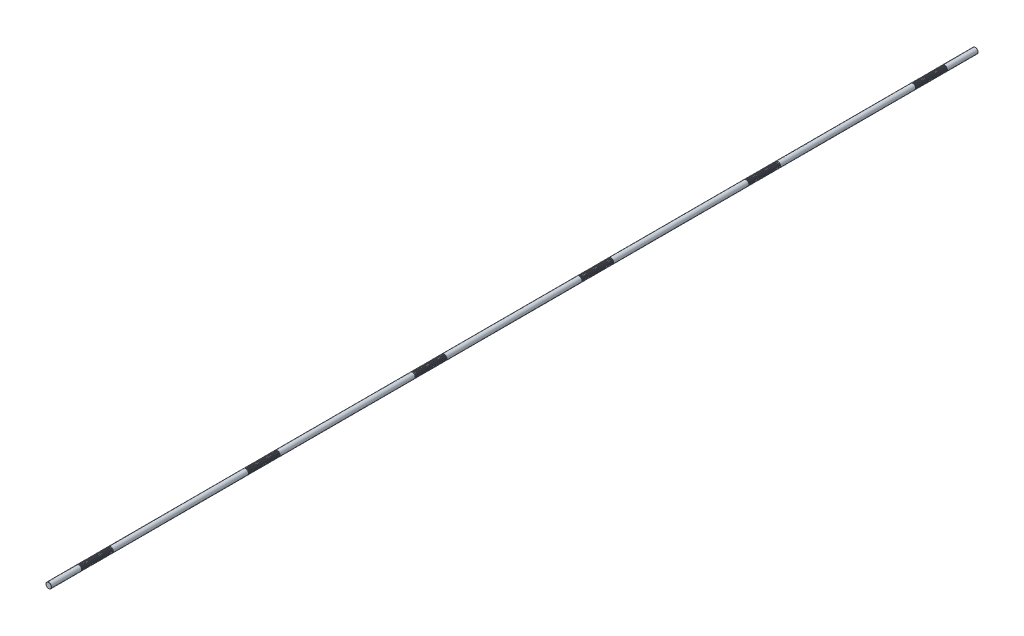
from build123d import *

# Parameters (mm, degrees)
SKETCH1_R           = 9
BOSS_EXTRUDE1_DEPTH = 1500
CHAMFER1_SIZE       = 0.45
LPATTERN1_COUNT     = 26
LPATTERN1_PITCH     = 4
LPATTERN2_COUNT     = 6
LPATTERN2_PITCH     = 540


with BuildPart() as part:
    # Sketch1 → Boss-Extrude1 (new, symmetric)
    with BuildSketch(Plane.XY):
        Circle(SKETCH1_R)
    extrude(amount=BOSS_EXTRUDE1_DEPTH, both=True)

    # Chamfer1
    chamfer1_edges = [part.edges().sort_by_distance(p)[0] for p in [
        (-9, 0, -1500),
        (-9, 0, 1500),
    ]]
    chamfer(chamfer1_edges, length=CHAMFER1_SIZE)

    # Sketch2 → Cut-Revolve1 (revolve, cut)
    with BuildSketch(Plane(origin=(0, 0, 0), x_dir=(0, 0, -1), z_dir=(1, 0, 0)), mode=Mode.PRIVATE) as cut_revolve1_sk:
        Polygon((1400.301442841, 9), (1397.698557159, 9), (1398.301442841, 6.75), (1399.698557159, 6.75), align=None)
    cut_revolve1 = revolve(cut_revolve1_sk.sketch.rotate(Axis((0, 0, 1500), (0, 0, -1)), 90), axis=Axis((0, 0, 1500), (0, 0, -1)), mode=Mode.SUBTRACT)

    # LPattern1: Cut-Revolve1 ×26
    with Locations(*[(0, 0, i * LPATTERN1_PITCH) for i in range(1, LPATTERN1_COUNT)]):
        add(cut_revolve1, mode=Mode.SUBTRACT)

    # LPattern2: Cut-Revolve1 ×6
    with Locations(*[(0, 0, i * LPATTERN2_PITCH) for i in range(1, LPATTERN2_COUNT)]):
        add(cut_revolve1, mode=Mode.SUBTRACT)

    # LPattern2 copy 1 sketch → LPattern2 copy 1 (revolve, cut)
    with BuildSketch(Plane(origin=(0, 0, 544), x_dir=(0, 0, -1), z_dir=(1, 0, 0))):
        Polygon((1400.301442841, 9), (1397.698557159, 9), (1398.301442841, 6.75), (1399.698557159, 6.75), align=None)
    revolve(axis=Axis((0, 0, 2044), (0, 0, -1)), mode=Mode.SUBTRACT)

    # LPattern2 copy 2 sketch → LPattern2 copy 2 (revolve, cut)
    with BuildSketch(Plane(origin=(0, 0, 1084), x_dir=(0, 0, -1), z_dir=(1, 0, 0))):
        Polygon((1400.301442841, 9), (1397.698557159, 9), (1398.301442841, 6.75), (1399.698557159, 6.75), align=None)
    revolve(axis=Axis((0, 0, 2584), (0, 0, -1)), mode=Mode.SUBTRACT)

    # LPattern2 copy 3 sketch → LPattern2 copy 3 (revolve, cut)
    with BuildSketch(Plane(origin=(0, 0, 1624), x_dir=(0, 0, -1), z_dir=(1, 0, 0))):
        Polygon((1400.301442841, 9), (1397.698557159, 9), (1398.301442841, 6.75), (1399.698557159, 6.75), align=None)
    revolve(axis=Axis((0, 0, 3124), (0, 0, -1)), mode=Mode.SUBTRACT)

    # LPattern2 copy 4 sketch → LPattern2 copy 4 (revolve, cut)
    with BuildSketch(Plane(origin=(0, 0, 2164), x_dir=(0, 0, -1), z_dir=(1, 0, 0))):
        Polygon((1400.301442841, 9), (1397.698557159, 9), (1398.301442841, 6.75), (1399.698557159, 6.75), align=None)
    revolve(axis=Axis((0, 0, 3664), (0, 0, -1)), mode=Mode.SUBTRACT)

    # LPattern2 copy 5 sketch → LPattern2 copy 5 (revolve, cut)
    with BuildSketch(Plane(origin=(0, 0, 2704), x_dir=(0, 0, -1), z_dir=(1, 0, 0))):
        Polygon((1400.301442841, 9), (1397.698557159, 9), (1398.301442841, 6.75), (1399.698557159, 6.75), align=None)
    revolve(axis=Axis((0, 0, 4204), (0, 0, -1)), mode=Mode.SUBTRACT)

    # LPattern2 copy 6 sketch → LPattern2 copy 6 (revolve, cut)
    with BuildSketch(Plane(origin=(0, 0, 548), x_dir=(0, 0, -1), z_dir=(1, 0, 0))):
        Polygon((1400.301442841, 9), (1397.698557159, 9), (1398.301442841, 6.75), (1399.698557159, 6.75), align=None)
    revolve(axis=Axis((0, 0, 2048), (0, 0, -1)), mode=Mode.SUBTRACT)

    # LPattern2 copy 7 sketch → LPattern2 copy 7 (revolve, cut)
    with BuildSketch(Plane(origin=(0, 0, 1088), x_dir=(0, 0, -1), z_dir=(1, 0, 0))):
        Polygon((1400.301442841, 9), (1397.698557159, 9), (1398.301442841, 6.75), (1399.698557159, 6.75), align=None)
    revolve(axis=Axis((0, 0, 2588), (0, 0, -1)), mode=Mode.SUBTRACT)

    # LPattern2 copy 8 sketch → LPattern2 copy 8 (revolve, cut)
    with BuildSketch(Plane(origin=(0, 0, 1628), x_dir=(0, 0, -1), z_dir=(1, 0, 0))):
        Polygon((1400.301442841, 9), (1397.698557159, 9), (1398.301442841, 6.75), (1399.698557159, 6.75), align=None)
    revolve(axis=Axis((0, 0, 3128), (0, 0, -1)), mode=Mode.SUBTRACT)

    # LPattern2 copy 9 sketch → LPattern2 copy 9 (revolve, cut)
    with BuildSketch(Plane(origin=(0, 0, 2168), x_dir=(0, 0, -1), z_dir=(1, 0, 0))):
        Polygon((1400.301442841, 9), (1397.698557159, 9), (1398.301442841, 6.75), (1399.698557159, 6.75), align=None)
    revolve(axis=Axis((0, 0, 3668), (0, 0, -1)), mode=Mode.SUBTRACT)

    # LPattern2 copy 10 sketch → LPattern2 copy 10 (revolve, cut)
    with BuildSketch(Plane(origin=(0, 0, 2708), x_dir=(0, 0, -1), z_dir=(1, 0, 0))):
        Polygon((1400.301442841, 9), (1397.698557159, 9), (1398.301442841, 6.75), (1399.698557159, 6.75), align=None)
    revolve(axis=Axis((0, 0, 4208), (0, 0, -1)), mode=Mode.SUBTRACT)

    # LPattern2 copy 11 sketch → LPattern2 copy 11 (revolve, cut)
    with BuildSketch(Plane(origin=(0, 0, 552), x_dir=(0, 0, -1), z_dir=(1, 0, 0))):
        Polygon((1400.301442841, 9), (1397.698557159, 9), (1398.301442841, 6.75), (1399.698557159, 6.75), align=None)
    revolve(axis=Axis((0, 0, 2052), (0, 0, -1)), mode=Mode.SUBTRACT)

    # LPattern2 copy 12 sketch → LPattern2 copy 12 (revolve, cut)
    with BuildSketch(Plane(origin=(0, 0, 1092), x_dir=(0, 0, -1), z_dir=(1, 0, 0))):
        Polygon((1400.301442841, 9), (1397.698557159, 9), (1398.301442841, 6.75), (1399.698557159, 6.75), align=None)
    revolve(axis=Axis((0, 0, 2592), (0, 0, -1)), mode=Mode.SUBTRACT)

    # LPattern2 copy 13 sketch → LPattern2 copy 13 (revolve, cut)
    with BuildSketch(Plane(origin=(0, 0, 1632), x_dir=(0, 0, -1), z_dir=(1, 0, 0))):
        Polygon((1400.301442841, 9), (1397.698557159, 9), (1398.301442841, 6.75), (1399.698557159, 6.75), align=None)
    revolve(axis=Axis((0, 0, 3132), (0, 0, -1)), mode=Mode.SUBTRACT)

    # LPattern2 copy 14 sketch → LPattern2 copy 14 (revolve, cut)
    with BuildSketch(Plane(origin=(0, 0, 2172), x_dir=(0, 0, -1), z_dir=(1, 0, 0))):
        Polygon((1400.301442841, 9), (1397.698557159, 9), (1398.301442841, 6.75), (1399.698557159, 6.75), align=None)
    revolve(axis=Axis((0, 0, 3672), (0, 0, -1)), mode=Mode.SUBTRACT)

    # LPattern2 copy 15 sketch → LPattern2 copy 15 (revolve, cut)
    with BuildSketch(Plane(origin=(0, 0, 2712), x_dir=(0, 0, -1), z_dir=(1, 0, 0))):
        Polygon((1400.301442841, 9), (1397.698557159, 9), (1398.301442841, 6.75), (1399.698557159, 6.75), align=None)
    revolve(axis=Axis((0, 0, 4212), (0, 0, -1)), mode=Mode.SUBTRACT)

    # LPattern2 copy 16 sketch → LPattern2 copy 16 (revolve, cut)
    with BuildSketch(Plane(origin=(0, 0, 556), x_dir=(0, 0, -1), z_dir=(1, 0, 0))):
        Polygon((1400.301442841, 9), (1397.698557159, 9), (1398.301442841, 6.75), (1399.698557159, 6.75), align=None)
    revolve(axis=Axis((0, 0, 2056), (0, 0, -1)), mode=Mode.SUBTRACT)

    # LPattern2 copy 17 sketch → LPattern2 copy 17 (revolve, cut)
    with BuildSketch(Plane(origin=(0, 0, 1096), x_dir=(0, 0, -1), z_dir=(1, 0, 0))):
        Polygon((1400.301442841, 9), (1397.698557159, 9), (1398.301442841, 6.75), (1399.698557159, 6.75), align=None)
    revolve(axis=Axis((0, 0, 2596), (0, 0, -1)), mode=Mode.SUBTRACT)

    # LPattern2 copy 18 sketch → LPattern2 copy 18 (revolve, cut)
    with BuildSketch(Plane(origin=(0, 0, 1636), x_dir=(0, 0, -1), z_dir=(1, 0, 0))):
        Polygon((1400.301442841, 9), (1397.698557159, 9), (1398.301442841, 6.75), (1399.698557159, 6.75), align=None)
    revolve(axis=Axis((0, 0, 3136), (0, 0, -1)), mode=Mode.SUBTRACT)

    # LPattern2 copy 19 sketch → LPattern2 copy 19 (revolve, cut)
    with BuildSketch(Plane(origin=(0, 0, 2176), x_dir=(0, 0, -1), z_dir=(1, 0, 0))):
        Polygon((1400.301442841, 9), (1397.698557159, 9), (1398.301442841, 6.75), (1399.698557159, 6.75), align=None)
    revolve(axis=Axis((0, 0, 3676), (0, 0, -1)), mode=Mode.SUBTRACT)

    # LPattern2 copy 20 sketch → LPattern2 copy 20 (revolve, cut)
    with BuildSketch(Plane(origin=(0, 0, 2716), x_dir=(0, 0, -1), z_dir=(1, 0, 0))):
        Polygon((1400.301442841, 9), (1397.698557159, 9), (1398.301442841, 6.75), (1399.698557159, 6.75), align=None)
    revolve(axis=Axis((0, 0, 4216), (0, 0, -1)), mode=Mode.SUBTRACT)

    # LPattern2 copy 21 sketch → LPattern2 copy 21 (revolve, cut)
    with BuildSketch(Plane(origin=(0, 0, 560), x_dir=(0, 0, -1), z_dir=(1, 0, 0))):
        Polygon((1400.301442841, 9), (1397.698557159, 9), (1398.301442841, 6.75), (1399.698557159, 6.75), align=None)
    revolve(axis=Axis((0, 0, 2060), (0, 0, -1)), mode=Mode.SUBTRACT)

    # LPattern2 copy 22 sketch → LPattern2 copy 22 (revolve, cut)
    with BuildSketch(Plane(origin=(0, 0, 1100), x_dir=(0, 0, -1), z_dir=(1, 0, 0))):
        Polygon((1400.301442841, 9), (1397.698557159, 9), (1398.301442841, 6.75), (1399.698557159, 6.75), align=None)
    revolve(axis=Axis((0, 0, 2600), (0, 0, -1)), mode=Mode.SUBTRACT)

    # LPattern2 copy 23 sketch → LPattern2 copy 23 (revolve, cut)
    with BuildSketch(Plane(origin=(0, 0, 1640), x_dir=(0, 0, -1), z_dir=(1, 0, 0))):
        Polygon((1400.301442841, 9), (1397.698557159, 9), (1398.301442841, 6.75), (1399.698557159, 6.75), align=None)
    revolve(axis=Axis((0, 0, 3140), (0, 0, -1)), mode=Mode.SUBTRACT)

    # LPattern2 copy 24 sketch → LPattern2 copy 24 (revolve, cut)
    with BuildSketch(Plane(origin=(0, 0, 2180), x_dir=(0, 0, -1), z_dir=(1, 0, 0))):
        Polygon((1400.301442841, 9), (1397.698557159, 9), (1398.301442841, 6.75), (1399.698557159, 6.75), align=None)
    revolve(axis=Axis((0, 0, 3680), (0, 0, -1)), mode=Mode.SUBTRACT)

    # LPattern2 copy 25 sketch → LPattern2 copy 25 (revolve, cut)
    with BuildSketch(Plane(origin=(0, 0, 2720), x_dir=(0, 0, -1), z_dir=(1, 0, 0))):
        Polygon((1400.301442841, 9), (1397.698557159, 9), (1398.301442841, 6.75), (1399.698557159, 6.75), align=None)
    revolve(axis=Axis((0, 0, 4220), (0, 0, -1)), mode=Mode.SUBTRACT)

    # LPattern2 copy 26 sketch → LPattern2 copy 26 (revolve, cut)
    with BuildSketch(Plane(origin=(0, 0, 564), x_dir=(0, 0, -1), z_dir=(1, 0, 0))):
        Polygon((1400.301442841, 9), (1397.698557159, 9), (1398.301442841, 6.75), (1399.698557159, 6.75), align=None)
    revolve(axis=Axis((0, 0, 2064), (0, 0, -1)), mode=Mode.SUBTRACT)

    # LPattern2 copy 27 sketch → LPattern2 copy 27 (revolve, cut)
    with BuildSketch(Plane(origin=(0, 0, 1104), x_dir=(0, 0, -1), z_dir=(1, 0, 0))):
        Polygon((1400.301442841, 9), (1397.698557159, 9), (1398.301442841, 6.75), (1399.698557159, 6.75), align=None)
    revolve(axis=Axis((0, 0, 2604), (0, 0, -1)), mode=Mode.SUBTRACT)

    # LPattern2 copy 28 sketch → LPattern2 copy 28 (revolve, cut)
    with BuildSketch(Plane(origin=(0, 0, 1644), x_dir=(0, 0, -1), z_dir=(1, 0, 0))):
        Polygon((1400.301442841, 9), (1397.698557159, 9), (1398.301442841, 6.75), (1399.698557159, 6.75), align=None)
    revolve(axis=Axis((0, 0, 3144), (0, 0, -1)), mode=Mode.SUBTRACT)

    # LPattern2 copy 29 sketch → LPattern2 copy 29 (revolve, cut)
    with BuildSketch(Plane(origin=(0, 0, 2184), x_dir=(0, 0, -1), z_dir=(1, 0, 0))):
        Polygon((1400.301442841, 9), (1397.698557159, 9), (1398.301442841, 6.75), (1399.698557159, 6.75), align=None)
    revolve(axis=Axis((0, 0, 3684), (0, 0, -1)), mode=Mode.SUBTRACT)

    # LPattern2 copy 30 sketch → LPattern2 copy 30 (revolve, cut)
    with BuildSketch(Plane(origin=(0, 0, 2724), x_dir=(0, 0, -1), z_dir=(1, 0, 0))):
        Polygon((1400.301442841, 9), (1397.698557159, 9), (1398.301442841, 6.75), (1399.698557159, 6.75), align=None)
    revolve(axis=Axis((0, 0, 4224), (0, 0, -1)), mode=Mode.SUBTRACT)

    # LPattern2 copy 31 sketch → LPattern2 copy 31 (revolve, cut)
    with BuildSketch(Plane(origin=(0, 0, 568), x_dir=(0, 0, -1), z_dir=(1, 0, 0))):
        Polygon((1400.301442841, 9), (1397.698557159, 9), (1398.301442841, 6.75), (1399.698557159, 6.75), align=None)
    revolve(axis=Axis((0, 0, 2068), (0, 0, -1)), mode=Mode.SUBTRACT)

    # LPattern2 copy 32 sketch → LPattern2 copy 32 (revolve, cut)
    with BuildSketch(Plane(origin=(0, 0, 1108), x_dir=(0, 0, -1), z_dir=(1, 0, 0))):
        Polygon((1400.301442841, 9), (1397.698557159, 9), (1398.301442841, 6.75), (1399.698557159, 6.75), align=None)
    revolve(axis=Axis((0, 0, 2608), (0, 0, -1)), mode=Mode.SUBTRACT)

    # LPattern2 copy 33 sketch → LPattern2 copy 33 (revolve, cut)
    with BuildSketch(Plane(origin=(0, 0, 1648), x_dir=(0, 0, -1), z_dir=(1, 0, 0))):
        Polygon((1400.301442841, 9), (1397.698557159, 9), (1398.301442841, 6.75), (1399.698557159, 6.75), align=None)
    revolve(axis=Axis((0, 0, 3148), (0, 0, -1)), mode=Mode.SUBTRACT)

    # LPattern2 copy 34 sketch → LPattern2 copy 34 (revolve, cut)
    with BuildSketch(Plane(origin=(0, 0, 2188), x_dir=(0, 0, -1), z_dir=(1, 0, 0))):
        Polygon((1400.301442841, 9), (1397.698557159, 9), (1398.301442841, 6.75), (1399.698557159, 6.75), align=None)
    revolve(axis=Axis((0, 0, 3688), (0, 0, -1)), mode=Mode.SUBTRACT)

    # LPattern2 copy 35 sketch → LPattern2 copy 35 (revolve, cut)
    with BuildSketch(Plane(origin=(0, 0, 2728), x_dir=(0, 0, -1), z_dir=(1, 0, 0))):
        Polygon((1400.301442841, 9), (1397.698557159, 9), (1398.301442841, 6.75), (1399.698557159, 6.75), align=None)
    revolve(axis=Axis((0, 0, 4228), (0, 0, -1)), mode=Mode.SUBTRACT)

    # LPattern2 copy 36 sketch → LPattern2 copy 36 (revolve, cut)
    with BuildSketch(Plane(origin=(0, 0, 572), x_dir=(0, 0, -1), z_dir=(1, 0, 0))):
        Polygon((1400.301442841, 9), (1397.698557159, 9), (1398.301442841, 6.75), (1399.698557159, 6.75), align=None)
    revolve(axis=Axis((0, 0, 2072), (0, 0, -1)), mode=Mode.SUBTRACT)

    # LPattern2 copy 37 sketch → LPattern2 copy 37 (revolve, cut)
    with BuildSketch(Plane(origin=(0, 0, 1112), x_dir=(0, 0, -1), z_dir=(1, 0, 0))):
        Polygon((1400.301442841, 9), (1397.698557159, 9), (1398.301442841, 6.75), (1399.698557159, 6.75), align=None)
    revolve(axis=Axis((0, 0, 2612), (0, 0, -1)), mode=Mode.SUBTRACT)

    # LPattern2 copy 38 sketch → LPattern2 copy 38 (revolve, cut)
    with BuildSketch(Plane(origin=(0, 0, 1652), x_dir=(0, 0, -1), z_dir=(1, 0, 0))):
        Polygon((1400.301442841, 9), (1397.698557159, 9), (1398.301442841, 6.75), (1399.698557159, 6.75), align=None)
    revolve(axis=Axis((0, 0, 3152), (0, 0, -1)), mode=Mode.SUBTRACT)

    # LPattern2 copy 39 sketch → LPattern2 copy 39 (revolve, cut)
    with BuildSketch(Plane(origin=(0, 0, 2192), x_dir=(0, 0, -1), z_dir=(1, 0, 0))):
        Polygon((1400.301442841, 9), (1397.698557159, 9), (1398.301442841, 6.75), (1399.698557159, 6.75), align=None)
    revolve(axis=Axis((0, 0, 3692), (0, 0, -1)), mode=Mode.SUBTRACT)

    # LPattern2 copy 40 sketch → LPattern2 copy 40 (revolve, cut)
    with BuildSketch(Plane(origin=(0, 0, 2732), x_dir=(0, 0, -1), z_dir=(1, 0, 0))):
        Polygon((1400.301442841, 9), (1397.698557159, 9), (1398.301442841, 6.75), (1399.698557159, 6.75), align=None)
    revolve(axis=Axis((0, 0, 4232), (0, 0, -1)), mode=Mode.SUBTRACT)

    # LPattern2 copy 41 sketch → LPattern2 copy 41 (revolve, cut)
    with BuildSketch(Plane(origin=(0, 0, 576), x_dir=(0, 0, -1), z_dir=(1, 0, 0))):
        Polygon((1400.301442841, 9), (1397.698557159, 9), (1398.301442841, 6.75), (1399.698557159, 6.75), align=None)
    revolve(axis=Axis((0, 0, 2076), (0, 0, -1)), mode=Mode.SUBTRACT)

    # LPattern2 copy 42 sketch → LPattern2 copy 42 (revolve, cut)
    with BuildSketch(Plane(origin=(0, 0, 1116), x_dir=(0, 0, -1), z_dir=(1, 0, 0))):
        Polygon((1400.301442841, 9), (1397.698557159, 9), (1398.301442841, 6.75), (1399.698557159, 6.75), align=None)
    revolve(axis=Axis((0, 0, 2616), (0, 0, -1)), mode=Mode.SUBTRACT)

    # LPattern2 copy 43 sketch → LPattern2 copy 43 (revolve, cut)
    with BuildSketch(Plane(origin=(0, 0, 1656), x_dir=(0, 0, -1), z_dir=(1, 0, 0))):
        Polygon((1400.301442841, 9), (1397.698557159, 9), (1398.301442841, 6.75), (1399.698557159, 6.75), align=None)
    revolve(axis=Axis((0, 0, 3156), (0, 0, -1)), mode=Mode.SUBTRACT)

    # LPattern2 copy 44 sketch → LPattern2 copy 44 (revolve, cut)
    with BuildSketch(Plane(origin=(0, 0, 2196), x_dir=(0, 0, -1), z_dir=(1, 0, 0))):
        Polygon((1400.301442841, 9), (1397.698557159, 9), (1398.301442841, 6.75), (1399.698557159, 6.75), align=None)
    revolve(axis=Axis((0, 0, 3696), (0, 0, -1)), mode=Mode.SUBTRACT)

    # LPattern2 copy 45 sketch → LPattern2 copy 45 (revolve, cut)
    with BuildSketch(Plane(origin=(0, 0, 2736), x_dir=(0, 0, -1), z_dir=(1, 0, 0))):
        Polygon((1400.301442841, 9), (1397.698557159, 9), (1398.301442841, 6.75), (1399.698557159, 6.75), align=None)
    revolve(axis=Axis((0, 0, 4236), (0, 0, -1)), mode=Mode.SUBTRACT)

    # LPattern2 copy 46 sketch → LPattern2 copy 46 (revolve, cut)
    with BuildSketch(Plane(origin=(0, 0, 580), x_dir=(0, 0, -1), z_dir=(1, 0, 0))):
        Polygon((1400.301442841, 9), (1397.698557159, 9), (1398.301442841, 6.75), (1399.698557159, 6.75), align=None)
    revolve(axis=Axis((0, 0, 2080), (0, 0, -1)), mode=Mode.SUBTRACT)

    # LPattern2 copy 47 sketch → LPattern2 copy 47 (revolve, cut)
    with BuildSketch(Plane(origin=(0, 0, 1120), x_dir=(0, 0, -1), z_dir=(1, 0, 0))):
        Polygon((1400.301442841, 9), (1397.698557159, 9), (1398.301442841, 6.75), (1399.698557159, 6.75), align=None)
    revolve(axis=Axis((0, 0, 2620), (0, 0, -1)), mode=Mode.SUBTRACT)

    # LPattern2 copy 48 sketch → LPattern2 copy 48 (revolve, cut)
    with BuildSketch(Plane(origin=(0, 0, 1660), x_dir=(0, 0, -1), z_dir=(1, 0, 0))):
        Polygon((1400.301442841, 9), (1397.698557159, 9), (1398.301442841, 6.75), (1399.698557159, 6.75), align=None)
    revolve(axis=Axis((0, 0, 3160), (0, 0, -1)), mode=Mode.SUBTRACT)

    # LPattern2 copy 49 sketch → LPattern2 copy 49 (revolve, cut)
    with BuildSketch(Plane(origin=(0, 0, 2200), x_dir=(0, 0, -1), z_dir=(1, 0, 0))):
        Polygon((1400.301442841, 9), (1397.698557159, 9), (1398.301442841, 6.75), (1399.698557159, 6.75), align=None)
    revolve(axis=Axis((0, 0, 3700), (0, 0, -1)), mode=Mode.SUBTRACT)

    # LPattern2 copy 50 sketch → LPattern2 copy 50 (revolve, cut)
    with BuildSketch(Plane(origin=(0, 0, 2740), x_dir=(0, 0, -1), z_dir=(1, 0, 0))):
        Polygon((1400.301442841, 9), (1397.698557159, 9), (1398.301442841, 6.75), (1399.698557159, 6.75), align=None)
    revolve(axis=Axis((0, 0, 4240), (0, 0, -1)), mode=Mode.SUBTRACT)

    # LPattern2 copy 51 sketch → LPattern2 copy 51 (revolve, cut)
    with BuildSketch(Plane(origin=(0, 0, 584), x_dir=(0, 0, -1), z_dir=(1, 0, 0))):
        Polygon((1400.301442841, 9), (1397.698557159, 9), (1398.301442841, 6.75), (1399.698557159, 6.75), align=None)
    revolve(axis=Axis((0, 0, 2084), (0, 0, -1)), mode=Mode.SUBTRACT)

    # LPattern2 copy 52 sketch → LPattern2 copy 52 (revolve, cut)
    with BuildSketch(Plane(origin=(0, 0, 1124), x_dir=(0, 0, -1), z_dir=(1, 0, 0))):
        Polygon((1400.301442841, 9), (1397.698557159, 9), (1398.301442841, 6.75), (1399.698557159, 6.75), align=None)
    revolve(axis=Axis((0, 0, 2624), (0, 0, -1)), mode=Mode.SUBTRACT)

    # LPattern2 copy 53 sketch → LPattern2 copy 53 (revolve, cut)
    with BuildSketch(Plane(origin=(0, 0, 1664), x_dir=(0, 0, -1), z_dir=(1, 0, 0))):
        Polygon((1400.301442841, 9), (1397.698557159, 9), (1398.301442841, 6.75), (1399.698557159, 6.75), align=None)
    revolve(axis=Axis((0, 0, 3164), (0, 0, -1)), mode=Mode.SUBTRACT)

    # LPattern2 copy 54 sketch → LPattern2 copy 54 (revolve, cut)
    with BuildSketch(Plane(origin=(0, 0, 2204), x_dir=(0, 0, -1), z_dir=(1, 0, 0))):
        Polygon((1400.301442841, 9), (1397.698557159, 9), (1398.301442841, 6.75), (1399.698557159, 6.75), align=None)
    revolve(axis=Axis((0, 0, 3704), (0, 0, -1)), mode=Mode.SUBTRACT)

    # LPattern2 copy 55 sketch → LPattern2 copy 55 (revolve, cut)
    with BuildSketch(Plane(origin=(0, 0, 2744), x_dir=(0, 0, -1), z_dir=(1, 0, 0))):
        Polygon((1400.301442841, 9), (1397.698557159, 9), (1398.301442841, 6.75), (1399.698557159, 6.75), align=None)
    revolve(axis=Axis((0, 0, 4244), (0, 0, -1)), mode=Mode.SUBTRACT)

    # LPattern2 copy 56 sketch → LPattern2 copy 56 (revolve, cut)
    with BuildSketch(Plane(origin=(0, 0, 588), x_dir=(0, 0, -1), z_dir=(1, 0, 0))):
        Polygon((1400.301442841, 9), (1397.698557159, 9), (1398.301442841, 6.75), (1399.698557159, 6.75), align=None)
    revolve(axis=Axis((0, 0, 2088), (0, 0, -1)), mode=Mode.SUBTRACT)

    # LPattern2 copy 57 sketch → LPattern2 copy 57 (revolve, cut)
    with BuildSketch(Plane(origin=(0, 0, 1128), x_dir=(0, 0, -1), z_dir=(1, 0, 0))):
        Polygon((1400.301442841, 9), (1397.698557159, 9), (1398.301442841, 6.75), (1399.698557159, 6.75), align=None)
    revolve(axis=Axis((0, 0, 2628), (0, 0, -1)), mode=Mode.SUBTRACT)

    # LPattern2 copy 58 sketch → LPattern2 copy 58 (revolve, cut)
    with BuildSketch(Plane(origin=(0, 0, 1668), x_dir=(0, 0, -1), z_dir=(1, 0, 0))):
        Polygon((1400.301442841, 9), (1397.698557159, 9), (1398.301442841, 6.75), (1399.698557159, 6.75), align=None)
    revolve(axis=Axis((0, 0, 3168), (0, 0, -1)), mode=Mode.SUBTRACT)

    # LPattern2 copy 59 sketch → LPattern2 copy 59 (revolve, cut)
    with BuildSketch(Plane(origin=(0, 0, 2208), x_dir=(0, 0, -1), z_dir=(1, 0, 0))):
        Polygon((1400.301442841, 9), (1397.698557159, 9), (1398.301442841, 6.75), (1399.698557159, 6.75), align=None)
    revolve(axis=Axis((0, 0, 3708), (0, 0, -1)), mode=Mode.SUBTRACT)

    # LPattern2 copy 60 sketch → LPattern2 copy 60 (revolve, cut)
    with BuildSketch(Plane(origin=(0, 0, 2748), x_dir=(0, 0, -1), z_dir=(1, 0, 0))):
        Polygon((1400.301442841, 9), (1397.698557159, 9), (1398.301442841, 6.75), (1399.698557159, 6.75), align=None)
    revolve(axis=Axis((0, 0, 4248), (0, 0, -1)), mode=Mode.SUBTRACT)

    # LPattern2 copy 61 sketch → LPattern2 copy 61 (revolve, cut)
    with BuildSketch(Plane(origin=(0, 0, 592), x_dir=(0, 0, -1), z_dir=(1, 0, 0))):
        Polygon((1400.301442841, 9), (1397.698557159, 9), (1398.301442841, 6.75), (1399.698557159, 6.75), align=None)
    revolve(axis=Axis((0, 0, 2092), (0, 0, -1)), mode=Mode.SUBTRACT)

    # LPattern2 copy 62 sketch → LPattern2 copy 62 (revolve, cut)
    with BuildSketch(Plane(origin=(0, 0, 1132), x_dir=(0, 0, -1), z_dir=(1, 0, 0))):
        Polygon((1400.301442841, 9), (1397.698557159, 9), (1398.301442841, 6.75), (1399.698557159, 6.75), align=None)
    revolve(axis=Axis((0, 0, 2632), (0, 0, -1)), mode=Mode.SUBTRACT)

    # LPattern2 copy 63 sketch → LPattern2 copy 63 (revolve, cut)
    with BuildSketch(Plane(origin=(0, 0, 1672), x_dir=(0, 0, -1), z_dir=(1, 0, 0))):
        Polygon((1400.301442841, 9), (1397.698557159, 9), (1398.301442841, 6.75), (1399.698557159, 6.75), align=None)
    revolve(axis=Axis((0, 0, 3172), (0, 0, -1)), mode=Mode.SUBTRACT)

    # LPattern2 copy 64 sketch → LPattern2 copy 64 (revolve, cut)
    with BuildSketch(Plane(origin=(0, 0, 2212), x_dir=(0, 0, -1), z_dir=(1, 0, 0))):
        Polygon((1400.301442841, 9), (1397.698557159, 9), (1398.301442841, 6.75), (1399.698557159, 6.75), align=None)
    revolve(axis=Axis((0, 0, 3712), (0, 0, -1)), mode=Mode.SUBTRACT)

    # LPattern2 copy 65 sketch → LPattern2 copy 65 (revolve, cut)
    with BuildSketch(Plane(origin=(0, 0, 2752), x_dir=(0, 0, -1), z_dir=(1, 0, 0))):
        Polygon((1400.301442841, 9), (1397.698557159, 9), (1398.301442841, 6.75), (1399.698557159, 6.75), align=None)
    revolve(axis=Axis((0, 0, 4252), (0, 0, -1)), mode=Mode.SUBTRACT)

    # LPattern2 copy 66 sketch → LPattern2 copy 66 (revolve, cut)
    with BuildSketch(Plane(origin=(0, 0, 596), x_dir=(0, 0, -1), z_dir=(1, 0, 0))):
        Polygon((1400.301442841, 9), (1397.698557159, 9), (1398.301442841, 6.75), (1399.698557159, 6.75), align=None)
    revolve(axis=Axis((0, 0, 2096), (0, 0, -1)), mode=Mode.SUBTRACT)

    # LPattern2 copy 67 sketch → LPattern2 copy 67 (revolve, cut)
    with BuildSketch(Plane(origin=(0, 0, 1136), x_dir=(0, 0, -1), z_dir=(1, 0, 0))):
        Polygon((1400.301442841, 9), (1397.698557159, 9), (1398.301442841, 6.75), (1399.698557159, 6.75), align=None)
    revolve(axis=Axis((0, 0, 2636), (0, 0, -1)), mode=Mode.SUBTRACT)

    # LPattern2 copy 68 sketch → LPattern2 copy 68 (revolve, cut)
    with BuildSketch(Plane(origin=(0, 0, 1676), x_dir=(0, 0, -1), z_dir=(1, 0, 0))):
        Polygon((1400.301442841, 9), (1397.698557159, 9), (1398.301442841, 6.75), (1399.698557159, 6.75), align=None)
    revolve(axis=Axis((0, 0, 3176), (0, 0, -1)), mode=Mode.SUBTRACT)

    # LPattern2 copy 69 sketch → LPattern2 copy 69 (revolve, cut)
    with BuildSketch(Plane(origin=(0, 0, 2216), x_dir=(0, 0, -1), z_dir=(1, 0, 0))):
        Polygon((1400.301442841, 9), (1397.698557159, 9), (1398.301442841, 6.75), (1399.698557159, 6.75), align=None)
    revolve(axis=Axis((0, 0, 3716), (0, 0, -1)), mode=Mode.SUBTRACT)

    # LPattern2 copy 70 sketch → LPattern2 copy 70 (revolve, cut)
    with BuildSketch(Plane(origin=(0, 0, 2756), x_dir=(0, 0, -1), z_dir=(1, 0, 0))):
        Polygon((1400.301442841, 9), (1397.698557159, 9), (1398.301442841, 6.75), (1399.698557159, 6.75), align=None)
    revolve(axis=Axis((0, 0, 4256), (0, 0, -1)), mode=Mode.SUBTRACT)

    # LPattern2 copy 71 sketch → LPattern2 copy 71 (revolve, cut)
    with BuildSketch(Plane(origin=(0, 0, 600), x_dir=(0, 0, -1), z_dir=(1, 0, 0))):
        Polygon((1400.301442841, 9), (1397.698557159, 9), (1398.301442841, 6.75), (1399.698557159, 6.75), align=None)
    revolve(axis=Axis((0, 0, 2100), (0, 0, -1)), mode=Mode.SUBTRACT)

    # LPattern2 copy 72 sketch → LPattern2 copy 72 (revolve, cut)
    with BuildSketch(Plane(origin=(0, 0, 1140), x_dir=(0, 0, -1), z_dir=(1, 0, 0))):
        Polygon((1400.301442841, 9), (1397.698557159, 9), (1398.301442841, 6.75), (1399.698557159, 6.75), align=None)
    revolve(axis=Axis((0, 0, 2640), (0, 0, -1)), mode=Mode.SUBTRACT)

    # LPattern2 copy 73 sketch → LPattern2 copy 73 (revolve, cut)
    with BuildSketch(Plane(origin=(0, 0, 1680), x_dir=(0, 0, -1), z_dir=(1, 0, 0))):
        Polygon((1400.301442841, 9), (1397.698557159, 9), (1398.301442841, 6.75), (1399.698557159, 6.75), align=None)
    revolve(axis=Axis((0, 0, 3180), (0, 0, -1)), mode=Mode.SUBTRACT)

    # LPattern2 copy 74 sketch → LPattern2 copy 74 (revolve, cut)
    with BuildSketch(Plane(origin=(0, 0, 2220), x_dir=(0, 0, -1), z_dir=(1, 0, 0))):
        Polygon((1400.301442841, 9), (1397.698557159, 9), (1398.301442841, 6.75), (1399.698557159, 6.75), align=None)
    revolve(axis=Axis((0, 0, 3720), (0, 0, -1)), mode=Mode.SUBTRACT)

    # LPattern2 copy 75 sketch → LPattern2 copy 75 (revolve, cut)
    with BuildSketch(Plane(origin=(0, 0, 2760), x_dir=(0, 0, -1), z_dir=(1, 0, 0))):
        Polygon((1400.301442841, 9), (1397.698557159, 9), (1398.301442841, 6.75), (1399.698557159, 6.75), align=None)
    revolve(axis=Axis((0, 0, 4260), (0, 0, -1)), mode=Mode.SUBTRACT)

    # LPattern2 copy 76 sketch → LPattern2 copy 76 (revolve, cut)
    with BuildSketch(Plane(origin=(0, 0, 604), x_dir=(0, 0, -1), z_dir=(1, 0, 0))):
        Polygon((1400.301442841, 9), (1397.698557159, 9), (1398.301442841, 6.75), (1399.698557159, 6.75), align=None)
    revolve(axis=Axis((0, 0, 2104), (0, 0, -1)), mode=Mode.SUBTRACT)

    # LPattern2 copy 77 sketch → LPattern2 copy 77 (revolve, cut)
    with BuildSketch(Plane(origin=(0, 0, 1144), x_dir=(0, 0, -1), z_dir=(1, 0, 0))):
        Polygon((1400.301442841, 9), (1397.698557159, 9), (1398.301442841, 6.75), (1399.698557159, 6.75), align=None)
    revolve(axis=Axis((0, 0, 2644), (0, 0, -1)), mode=Mode.SUBTRACT)

    # LPattern2 copy 78 sketch → LPattern2 copy 78 (revolve, cut)
    with BuildSketch(Plane(origin=(0, 0, 1684), x_dir=(0, 0, -1), z_dir=(1, 0, 0))):
        Polygon((1400.301442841, 9), (1397.698557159, 9), (1398.301442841, 6.75), (1399.698557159, 6.75), align=None)
    revolve(axis=Axis((0, 0, 3184), (0, 0, -1)), mode=Mode.SUBTRACT)

    # LPattern2 copy 79 sketch → LPattern2 copy 79 (revolve, cut)
    with BuildSketch(Plane(origin=(0, 0, 2224), x_dir=(0, 0, -1), z_dir=(1, 0, 0))):
        Polygon((1400.301442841, 9), (1397.698557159, 9), (1398.301442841, 6.75), (1399.698557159, 6.75), align=None)
    revolve(axis=Axis((0, 0, 3724), (0, 0, -1)), mode=Mode.SUBTRACT)

    # LPattern2 copy 80 sketch → LPattern2 copy 80 (revolve, cut)
    with BuildSketch(Plane(origin=(0, 0, 2764), x_dir=(0, 0, -1), z_dir=(1, 0, 0))):
        Polygon((1400.301442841, 9), (1397.698557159, 9), (1398.301442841, 6.75), (1399.698557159, 6.75), align=None)
    revolve(axis=Axis((0, 0, 4264), (0, 0, -1)), mode=Mode.SUBTRACT)

    # LPattern2 copy 81 sketch → LPattern2 copy 81 (revolve, cut)
    with BuildSketch(Plane(origin=(0, 0, 608), x_dir=(0, 0, -1), z_dir=(1, 0, 0))):
        Polygon((1400.301442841, 9), (1397.698557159, 9), (1398.301442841, 6.75), (1399.698557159, 6.75), align=None)
    revolve(axis=Axis((0, 0, 2108), (0, 0, -1)), mode=Mode.SUBTRACT)

    # LPattern2 copy 82 sketch → LPattern2 copy 82 (revolve, cut)
    with BuildSketch(Plane(origin=(0, 0, 1148), x_dir=(0, 0, -1), z_dir=(1, 0, 0))):
        Polygon((1400.301442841, 9), (1397.698557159, 9), (1398.301442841, 6.75), (1399.698557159, 6.75), align=None)
    revolve(axis=Axis((0, 0, 2648), (0, 0, -1)), mode=Mode.SUBTRACT)

    # LPattern2 copy 83 sketch → LPattern2 copy 83 (revolve, cut)
    with BuildSketch(Plane(origin=(0, 0, 1688), x_dir=(0, 0, -1), z_dir=(1, 0, 0))):
        Polygon((1400.301442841, 9), (1397.698557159, 9), (1398.301442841, 6.75), (1399.698557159, 6.75), align=None)
    revolve(axis=Axis((0, 0, 3188), (0, 0, -1)), mode=Mode.SUBTRACT)

    # LPattern2 copy 84 sketch → LPattern2 copy 84 (revolve, cut)
    with BuildSketch(Plane(origin=(0, 0, 2228), x_dir=(0, 0, -1), z_dir=(1, 0, 0))):
        Polygon((1400.301442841, 9), (1397.698557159, 9), (1398.301442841, 6.75), (1399.698557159, 6.75), align=None)
    revolve(axis=Axis((0, 0, 3728), (0, 0, -1)), mode=Mode.SUBTRACT)

    # LPattern2 copy 85 sketch → LPattern2 copy 85 (revolve, cut)
    with BuildSketch(Plane(origin=(0, 0, 2768), x_dir=(0, 0, -1), z_dir=(1, 0, 0))):
        Polygon((1400.301442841, 9), (1397.698557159, 9), (1398.301442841, 6.75), (1399.698557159, 6.75), align=None)
    revolve(axis=Axis((0, 0, 4268), (0, 0, -1)), mode=Mode.SUBTRACT)

    # LPattern2 copy 86 sketch → LPattern2 copy 86 (revolve, cut)
    with BuildSketch(Plane(origin=(0, 0, 612), x_dir=(0, 0, -1), z_dir=(1, 0, 0))):
        Polygon((1400.301442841, 9), (1397.698557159, 9), (1398.301442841, 6.75), (1399.698557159, 6.75), align=None)
    revolve(axis=Axis((0, 0, 2112), (0, 0, -1)), mode=Mode.SUBTRACT)

    # LPattern2 copy 87 sketch → LPattern2 copy 87 (revolve, cut)
    with BuildSketch(Plane(origin=(0, 0, 1152), x_dir=(0, 0, -1), z_dir=(1, 0, 0))):
        Polygon((1400.301442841, 9), (1397.698557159, 9), (1398.301442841, 6.75), (1399.698557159, 6.75), align=None)
    revolve(axis=Axis((0, 0, 2652), (0, 0, -1)), mode=Mode.SUBTRACT)

    # LPattern2 copy 88 sketch → LPattern2 copy 88 (revolve, cut)
    with BuildSketch(Plane(origin=(0, 0, 1692), x_dir=(0, 0, -1), z_dir=(1, 0, 0))):
        Polygon((1400.301442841, 9), (1397.698557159, 9), (1398.301442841, 6.75), (1399.698557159, 6.75), align=None)
    revolve(axis=Axis((0, 0, 3192), (0, 0, -1)), mode=Mode.SUBTRACT)

    # LPattern2 copy 89 sketch → LPattern2 copy 89 (revolve, cut)
    with BuildSketch(Plane(origin=(0, 0, 2232), x_dir=(0, 0, -1), z_dir=(1, 0, 0))):
        Polygon((1400.301442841, 9), (1397.698557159, 9), (1398.301442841, 6.75), (1399.698557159, 6.75), align=None)
    revolve(axis=Axis((0, 0, 3732), (0, 0, -1)), mode=Mode.SUBTRACT)

    # LPattern2 copy 90 sketch → LPattern2 copy 90 (revolve, cut)
    with BuildSketch(Plane(origin=(0, 0, 2772), x_dir=(0, 0, -1), z_dir=(1, 0, 0))):
        Polygon((1400.301442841, 9), (1397.698557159, 9), (1398.301442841, 6.75), (1399.698557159, 6.75), align=None)
    revolve(axis=Axis((0, 0, 4272), (0, 0, -1)), mode=Mode.SUBTRACT)

    # LPattern2 copy 91 sketch → LPattern2 copy 91 (revolve, cut)
    with BuildSketch(Plane(origin=(0, 0, 616), x_dir=(0, 0, -1), z_dir=(1, 0, 0))):
        Polygon((1400.301442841, 9), (1397.698557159, 9), (1398.301442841, 6.75), (1399.698557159, 6.75), align=None)
    revolve(axis=Axis((0, 0, 2116), (0, 0, -1)), mode=Mode.SUBTRACT)

    # LPattern2 copy 92 sketch → LPattern2 copy 92 (revolve, cut)
    with BuildSketch(Plane(origin=(0, 0, 1156), x_dir=(0, 0, -1), z_dir=(1, 0, 0))):
        Polygon((1400.301442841, 9), (1397.698557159, 9), (1398.301442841, 6.75), (1399.698557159, 6.75), align=None)
    revolve(axis=Axis((0, 0, 2656), (0, 0, -1)), mode=Mode.SUBTRACT)

    # LPattern2 copy 93 sketch → LPattern2 copy 93 (revolve, cut)
    with BuildSketch(Plane(origin=(0, 0, 1696), x_dir=(0, 0, -1), z_dir=(1, 0, 0))):
        Polygon((1400.301442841, 9), (1397.698557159, 9), (1398.301442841, 6.75), (1399.698557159, 6.75), align=None)
    revolve(axis=Axis((0, 0, 3196), (0, 0, -1)), mode=Mode.SUBTRACT)

    # LPattern2 copy 94 sketch → LPattern2 copy 94 (revolve, cut)
    with BuildSketch(Plane(origin=(0, 0, 2236), x_dir=(0, 0, -1), z_dir=(1, 0, 0))):
        Polygon((1400.301442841, 9), (1397.698557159, 9), (1398.301442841, 6.75), (1399.698557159, 6.75), align=None)
    revolve(axis=Axis((0, 0, 3736), (0, 0, -1)), mode=Mode.SUBTRACT)

    # LPattern2 copy 95 sketch → LPattern2 copy 95 (revolve, cut)
    with BuildSketch(Plane(origin=(0, 0, 2776), x_dir=(0, 0, -1), z_dir=(1, 0, 0))):
        Polygon((1400.301442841, 9), (1397.698557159, 9), (1398.301442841, 6.75), (1399.698557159, 6.75), align=None)
    revolve(axis=Axis((0, 0, 4276), (0, 0, -1)), mode=Mode.SUBTRACT)

    # LPattern2 copy 96 sketch → LPattern2 copy 96 (revolve, cut)
    with BuildSketch(Plane(origin=(0, 0, 620), x_dir=(0, 0, -1), z_dir=(1, 0, 0))):
        Polygon((1400.301442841, 9), (1397.698557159, 9), (1398.301442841, 6.75), (1399.698557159, 6.75), align=None)
    revolve(axis=Axis((0, 0, 2120), (0, 0, -1)), mode=Mode.SUBTRACT)

    # LPattern2 copy 97 sketch → LPattern2 copy 97 (revolve, cut)
    with BuildSketch(Plane(origin=(0, 0, 1160), x_dir=(0, 0, -1), z_dir=(1, 0, 0))):
        Polygon((1400.301442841, 9), (1397.698557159, 9), (1398.301442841, 6.75), (1399.698557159, 6.75), align=None)
    revolve(axis=Axis((0, 0, 2660), (0, 0, -1)), mode=Mode.SUBTRACT)

    # LPattern2 copy 98 sketch → LPattern2 copy 98 (revolve, cut)
    with BuildSketch(Plane(origin=(0, 0, 1700), x_dir=(0, 0, -1), z_dir=(1, 0, 0))):
        Polygon((1400.301442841, 9), (1397.698557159, 9), (1398.301442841, 6.75), (1399.698557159, 6.75), align=None)
    revolve(axis=Axis((0, 0, 3200), (0, 0, -1)), mode=Mode.SUBTRACT)

    # LPattern2 copy 99 sketch → LPattern2 copy 99 (revolve, cut)
    with BuildSketch(Plane(origin=(0, 0, 2240), x_dir=(0, 0, -1), z_dir=(1, 0, 0))):
        Polygon((1400.301442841, 9), (1397.698557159, 9), (1398.301442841, 6.75), (1399.698557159, 6.75), align=None)
    revolve(axis=Axis((0, 0, 3740), (0, 0, -1)), mode=Mode.SUBTRACT)

    # LPattern2 copy 100 sketch → LPattern2 copy 100 (revolve, cut)
    with BuildSketch(Plane(origin=(0, 0, 2780), x_dir=(0, 0, -1), z_dir=(1, 0, 0))):
        Polygon((1400.301442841, 9), (1397.698557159, 9), (1398.301442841, 6.75), (1399.698557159, 6.75), align=None)
    revolve(axis=Axis((0, 0, 4280), (0, 0, -1)), mode=Mode.SUBTRACT)

    # LPattern2 copy 101 sketch → LPattern2 copy 101 (revolve, cut)
    with BuildSketch(Plane(origin=(0, 0, 624), x_dir=(0, 0, -1), z_dir=(1, 0, 0))):
        Polygon((1400.301442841, 9), (1397.698557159, 9), (1398.301442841, 6.75), (1399.698557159, 6.75), align=None)
    revolve(axis=Axis((0, 0, 2124), (0, 0, -1)), mode=Mode.SUBTRACT)

    # LPattern2 copy 102 sketch → LPattern2 copy 102 (revolve, cut)
    with BuildSketch(Plane(origin=(0, 0, 1164), x_dir=(0, 0, -1), z_dir=(1, 0, 0))):
        Polygon((1400.301442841, 9), (1397.698557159, 9), (1398.301442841, 6.75), (1399.698557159, 6.75), align=None)
    revolve(axis=Axis((0, 0, 2664), (0, 0, -1)), mode=Mode.SUBTRACT)

    # LPattern2 copy 103 sketch → LPattern2 copy 103 (revolve, cut)
    with BuildSketch(Plane(origin=(0, 0, 1704), x_dir=(0, 0, -1), z_dir=(1, 0, 0))):
        Polygon((1400.301442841, 9), (1397.698557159, 9), (1398.301442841, 6.75), (1399.698557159, 6.75), align=None)
    revolve(axis=Axis((0, 0, 3204), (0, 0, -1)), mode=Mode.SUBTRACT)

    # LPattern2 copy 104 sketch → LPattern2 copy 104 (revolve, cut)
    with BuildSketch(Plane(origin=(0, 0, 2244), x_dir=(0, 0, -1), z_dir=(1, 0, 0))):
        Polygon((1400.301442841, 9), (1397.698557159, 9), (1398.301442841, 6.75), (1399.698557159, 6.75), align=None)
    revolve(axis=Axis((0, 0, 3744), (0, 0, -1)), mode=Mode.SUBTRACT)

    # LPattern2 copy 105 sketch → LPattern2 copy 105 (revolve, cut)
    with BuildSketch(Plane(origin=(0, 0, 2784), x_dir=(0, 0, -1), z_dir=(1, 0, 0))):
        Polygon((1400.301442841, 9), (1397.698557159, 9), (1398.301442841, 6.75), (1399.698557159, 6.75), align=None)
    revolve(axis=Axis((0, 0, 4284), (0, 0, -1)), mode=Mode.SUBTRACT)

    # LPattern2 copy 106 sketch → LPattern2 copy 106 (revolve, cut)
    with BuildSketch(Plane(origin=(0, 0, 628), x_dir=(0, 0, -1), z_dir=(1, 0, 0))):
        Polygon((1400.301442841, 9), (1397.698557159, 9), (1398.301442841, 6.75), (1399.698557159, 6.75), align=None)
    revolve(axis=Axis((0, 0, 2128), (0, 0, -1)), mode=Mode.SUBTRACT)

    # LPattern2 copy 107 sketch → LPattern2 copy 107 (revolve, cut)
    with BuildSketch(Plane(origin=(0, 0, 1168), x_dir=(0, 0, -1), z_dir=(1, 0, 0))):
        Polygon((1400.301442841, 9), (1397.698557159, 9), (1398.301442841, 6.75), (1399.698557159, 6.75), align=None)
    revolve(axis=Axis((0, 0, 2668), (0, 0, -1)), mode=Mode.SUBTRACT)

    # LPattern2 copy 108 sketch → LPattern2 copy 108 (revolve, cut)
    with BuildSketch(Plane(origin=(0, 0, 1708), x_dir=(0, 0, -1), z_dir=(1, 0, 0))):
        Polygon((1400.301442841, 9), (1397.698557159, 9), (1398.301442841, 6.75), (1399.698557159, 6.75), align=None)
    revolve(axis=Axis((0, 0, 3208), (0, 0, -1)), mode=Mode.SUBTRACT)

    # LPattern2 copy 109 sketch → LPattern2 copy 109 (revolve, cut)
    with BuildSketch(Plane(origin=(0, 0, 2248), x_dir=(0, 0, -1), z_dir=(1, 0, 0))):
        Polygon((1400.301442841, 9), (1397.698557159, 9), (1398.301442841, 6.75), (1399.698557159, 6.75), align=None)
    revolve(axis=Axis((0, 0, 3748), (0, 0, -1)), mode=Mode.SUBTRACT)

    # LPattern2 copy 110 sketch → LPattern2 copy 110 (revolve, cut)
    with BuildSketch(Plane(origin=(0, 0, 2788), x_dir=(0, 0, -1), z_dir=(1, 0, 0))):
        Polygon((1400.301442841, 9), (1397.698557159, 9), (1398.301442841, 6.75), (1399.698557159, 6.75), align=None)
    revolve(axis=Axis((0, 0, 4288), (0, 0, -1)), mode=Mode.SUBTRACT)

    # LPattern2 copy 111 sketch → LPattern2 copy 111 (revolve, cut)
    with BuildSketch(Plane(origin=(0, 0, 632), x_dir=(0, 0, -1), z_dir=(1, 0, 0))):
        Polygon((1400.301442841, 9), (1397.698557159, 9), (1398.301442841, 6.75), (1399.698557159, 6.75), align=None)
    revolve(axis=Axis((0, 0, 2132), (0, 0, -1)), mode=Mode.SUBTRACT)

    # LPattern2 copy 112 sketch → LPattern2 copy 112 (revolve, cut)
    with BuildSketch(Plane(origin=(0, 0, 1172), x_dir=(0, 0, -1), z_dir=(1, 0, 0))):
        Polygon((1400.301442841, 9), (1397.698557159, 9), (1398.301442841, 6.75), (1399.698557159, 6.75), align=None)
    revolve(axis=Axis((0, 0, 2672), (0, 0, -1)), mode=Mode.SUBTRACT)

    # LPattern2 copy 113 sketch → LPattern2 copy 113 (revolve, cut)
    with BuildSketch(Plane(origin=(0, 0, 1712), x_dir=(0, 0, -1), z_dir=(1, 0, 0))):
        Polygon((1400.301442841, 9), (1397.698557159, 9), (1398.301442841, 6.75), (1399.698557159, 6.75), align=None)
    revolve(axis=Axis((0, 0, 3212), (0, 0, -1)), mode=Mode.SUBTRACT)

    # LPattern2 copy 114 sketch → LPattern2 copy 114 (revolve, cut)
    with BuildSketch(Plane(origin=(0, 0, 2252), x_dir=(0, 0, -1), z_dir=(1, 0, 0))):
        Polygon((1400.301442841, 9), (1397.698557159, 9), (1398.301442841, 6.75), (1399.698557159, 6.75), align=None)
    revolve(axis=Axis((0, 0, 3752), (0, 0, -1)), mode=Mode.SUBTRACT)

    # LPattern2 copy 115 sketch → LPattern2 copy 115 (revolve, cut)
    with BuildSketch(Plane(origin=(0, 0, 2792), x_dir=(0, 0, -1), z_dir=(1, 0, 0))):
        Polygon((1400.301442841, 9), (1397.698557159, 9), (1398.301442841, 6.75), (1399.698557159, 6.75), align=None)
    revolve(axis=Axis((0, 0, 4292), (0, 0, -1)), mode=Mode.SUBTRACT)

    # LPattern2 copy 116 sketch → LPattern2 copy 116 (revolve, cut)
    with BuildSketch(Plane(origin=(0, 0, 636), x_dir=(0, 0, -1), z_dir=(1, 0, 0))):
        Polygon((1400.301442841, 9), (1397.698557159, 9), (1398.301442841, 6.75), (1399.698557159, 6.75), align=None)
    revolve(axis=Axis((0, 0, 2136), (0, 0, -1)), mode=Mode.SUBTRACT)

    # LPattern2 copy 117 sketch → LPattern2 copy 117 (revolve, cut)
    with BuildSketch(Plane(origin=(0, 0, 1176), x_dir=(0, 0, -1), z_dir=(1, 0, 0))):
        Polygon((1400.301442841, 9), (1397.698557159, 9), (1398.301442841, 6.75), (1399.698557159, 6.75), align=None)
    revolve(axis=Axis((0, 0, 2676), (0, 0, -1)), mode=Mode.SUBTRACT)

    # LPattern2 copy 118 sketch → LPattern2 copy 118 (revolve, cut)
    with BuildSketch(Plane(origin=(0, 0, 1716), x_dir=(0, 0, -1), z_dir=(1, 0, 0))):
        Polygon((1400.301442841, 9), (1397.698557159, 9), (1398.301442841, 6.75), (1399.698557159, 6.75), align=None)
    revolve(axis=Axis((0, 0, 3216), (0, 0, -1)), mode=Mode.SUBTRACT)

    # LPattern2 copy 119 sketch → LPattern2 copy 119 (revolve, cut)
    with BuildSketch(Plane(origin=(0, 0, 2256), x_dir=(0, 0, -1), z_dir=(1, 0, 0))):
        Polygon((1400.301442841, 9), (1397.698557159, 9), (1398.301442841, 6.75), (1399.698557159, 6.75), align=None)
    revolve(axis=Axis((0, 0, 3756), (0, 0, -1)), mode=Mode.SUBTRACT)

    # LPattern2 copy 120 sketch → LPattern2 copy 120 (revolve, cut)
    with BuildSketch(Plane(origin=(0, 0, 2796), x_dir=(0, 0, -1), z_dir=(1, 0, 0))):
        Polygon((1400.301442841, 9), (1397.698557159, 9), (1398.301442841, 6.75), (1399.698557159, 6.75), align=None)
    revolve(axis=Axis((0, 0, 4296), (0, 0, -1)), mode=Mode.SUBTRACT)

    # LPattern2 copy 121 sketch → LPattern2 copy 121 (revolve, cut)
    with BuildSketch(Plane(origin=(0, 0, 640), x_dir=(0, 0, -1), z_dir=(1, 0, 0))):
        Polygon((1400.301442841, 9), (1397.698557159, 9), (1398.301442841, 6.75), (1399.698557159, 6.75), align=None)
    revolve(axis=Axis((0, 0, 2140), (0, 0, -1)), mode=Mode.SUBTRACT)

    # LPattern2 copy 122 sketch → LPattern2 copy 122 (revolve, cut)
    with BuildSketch(Plane(origin=(0, 0, 1180), x_dir=(0, 0, -1), z_dir=(1, 0, 0))):
        Polygon((1400.301442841, 9), (1397.698557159, 9), (1398.301442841, 6.75), (1399.698557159, 6.75), align=None)
    revolve(axis=Axis((0, 0, 2680), (0, 0, -1)), mode=Mode.SUBTRACT)

    # LPattern2 copy 123 sketch → LPattern2 copy 123 (revolve, cut)
    with BuildSketch(Plane(origin=(0, 0, 1720), x_dir=(0, 0, -1), z_dir=(1, 0, 0))):
        Polygon((1400.301442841, 9), (1397.698557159, 9), (1398.301442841, 6.75), (1399.698557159, 6.75), align=None)
    revolve(axis=Axis((0, 0, 3220), (0, 0, -1)), mode=Mode.SUBTRACT)

    # LPattern2 copy 124 sketch → LPattern2 copy 124 (revolve, cut)
    with BuildSketch(Plane(origin=(0, 0, 2260), x_dir=(0, 0, -1), z_dir=(1, 0, 0))):
        Polygon((1400.301442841, 9), (1397.698557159, 9), (1398.301442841, 6.75), (1399.698557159, 6.75), align=None)
    revolve(axis=Axis((0, 0, 3760), (0, 0, -1)), mode=Mode.SUBTRACT)

    # LPattern2 copy 125 sketch → LPattern2 copy 125 (revolve, cut)
    with BuildSketch(Plane(origin=(0, 0, 2800), x_dir=(0, 0, -1), z_dir=(1, 0, 0))):
        Polygon((1400.301442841, 9), (1397.698557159, 9), (1398.301442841, 6.75), (1399.698557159, 6.75), align=None)
    revolve(axis=Axis((0, 0, 4300), (0, 0, -1)), mode=Mode.SUBTRACT)


solid = part.part
